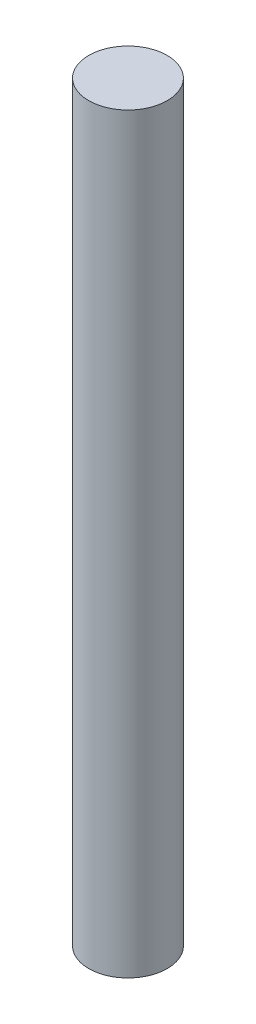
ISO-10303-21;
HEADER;
FILE_DESCRIPTION(('STEP AP214'),'2;1');
FILE_NAME('part.step','',(''),(''),'','','');
FILE_SCHEMA(('AUTOMOTIVE_DESIGN { 1 0 10303 214 1 1 1 1 }'));
ENDSEC;
DATA;
#1=APPLICATION_CONTEXT('core data for automotive mechanical design processes');
#2=APPLICATION_PROTOCOL_DEFINITION('international standard','automotive_design',2000,#1);
#3=PRODUCT_CONTEXT('',#1,'mechanical');
#4=PRODUCT('Part','Part','',(#3));
#5=PRODUCT_RELATED_PRODUCT_CATEGORY('part','',(#4));
#6=PRODUCT_DEFINITION_FORMATION('','',#4);
#7=PRODUCT_DEFINITION_CONTEXT('part definition',#1,'design');
#8=PRODUCT_DEFINITION('design','',#6,#7);
#9=PRODUCT_DEFINITION_SHAPE('','',#8);
#10=(LENGTH_UNIT() NAMED_UNIT(*) SI_UNIT(.MILLI.,.METRE.));
#11=(NAMED_UNIT(*) PLANE_ANGLE_UNIT() SI_UNIT($,.RADIAN.));
#12=(NAMED_UNIT(*) SI_UNIT($,.STERADIAN.) SOLID_ANGLE_UNIT());
#13=UNCERTAINTY_MEASURE_WITH_UNIT(LENGTH_MEASURE(1.E-05),#10,'distance_accuracy_value','');
#14=(GEOMETRIC_REPRESENTATION_CONTEXT(3) GLOBAL_UNCERTAINTY_ASSIGNED_CONTEXT((#13)) GLOBAL_UNIT_ASSIGNED_CONTEXT((#10,
#11,#12)) REPRESENTATION_CONTEXT('',''));
#15=CARTESIAN_POINT('',(0.,0.,0.));
#16=DIRECTION('',(0.,0.,1.));
#17=DIRECTION('',(1.,0.,0.));
#18=AXIS2_PLACEMENT_3D('',#15,#16,#17);
#19=CARTESIAN_POINT('',(0.,50.,0.));
#20=DIRECTION('',(0.,-1.,0.));
#21=DIRECTION('',(0.,0.,-1.));
#22=AXIS2_PLACEMENT_3D('',#19,#20,#21);
#23=CYLINDRICAL_SURFACE('',#22,2.60949965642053);
#24=CARTESIAN_POINT('',(0.,50.,0.));
#25=DIRECTION('',(0.,1.,0.));
#26=DIRECTION('',(0.,0.,1.));
#27=AXIS2_PLACEMENT_3D('',#24,#25,#26);
#28=CIRCLE('',#27,2.60949965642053);
#29=CARTESIAN_POINT('',(0.,50.,2.60949965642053));
#30=VERTEX_POINT('',#29);
#31=EDGE_CURVE('E10',#30,#30,#28,.T.);
#32=ORIENTED_EDGE('',*,*,#31,.F.);
#33=EDGE_LOOP('',(#32));
#34=FACE_BOUND('',#33,.T.);
#35=CARTESIAN_POINT('',(0.,0.,0.));
#36=DIRECTION('',(0.,1.,0.));
#37=DIRECTION('',(0.,0.,1.));
#38=AXIS2_PLACEMENT_3D('',#35,#36,#37);
#39=CIRCLE('',#38,2.60949965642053);
#40=CARTESIAN_POINT('',(0.,0.,2.60949965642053));
#41=VERTEX_POINT('',#40);
#42=EDGE_CURVE('E40',#41,#41,#39,.T.);
#43=ORIENTED_EDGE('',*,*,#42,.T.);
#44=EDGE_LOOP('',(#43));
#45=FACE_BOUND('',#44,.T.);
#46=ADVANCED_FACE('F37',(#34,#45),#23,.T.);
#47=CARTESIAN_POINT('',(0.,50.,0.));
#48=DIRECTION('',(0.,1.,0.));
#49=DIRECTION('',(0.,0.,1.));
#50=AXIS2_PLACEMENT_3D('',#47,#48,#49);
#51=PLANE('',#50);
#52=ORIENTED_EDGE('',*,*,#31,.T.);
#53=EDGE_LOOP('',(#52));
#54=FACE_BOUND('',#53,.T.);
#55=ADVANCED_FACE('F54',(#54),#51,.T.);
#56=CARTESIAN_POINT('',(0.,0.,0.));
#57=DIRECTION('',(0.,1.,0.));
#58=DIRECTION('',(0.,0.,1.));
#59=AXIS2_PLACEMENT_3D('',#56,#57,#58);
#60=PLANE('',#59);
#61=ORIENTED_EDGE('',*,*,#42,.F.);
#62=EDGE_LOOP('',(#61));
#63=FACE_BOUND('',#62,.T.);
#64=ADVANCED_FACE('F52',(#63),#60,.F.);
#65=CLOSED_SHELL('',(#46,#55,#64));
#66=MANIFOLD_SOLID_BREP('B2',#65);
#67=ADVANCED_BREP_SHAPE_REPRESENTATION('',(#18,#66),#14);
#68=SHAPE_DEFINITION_REPRESENTATION(#9,#67);
ENDSEC;
END-ISO-10303-21;
